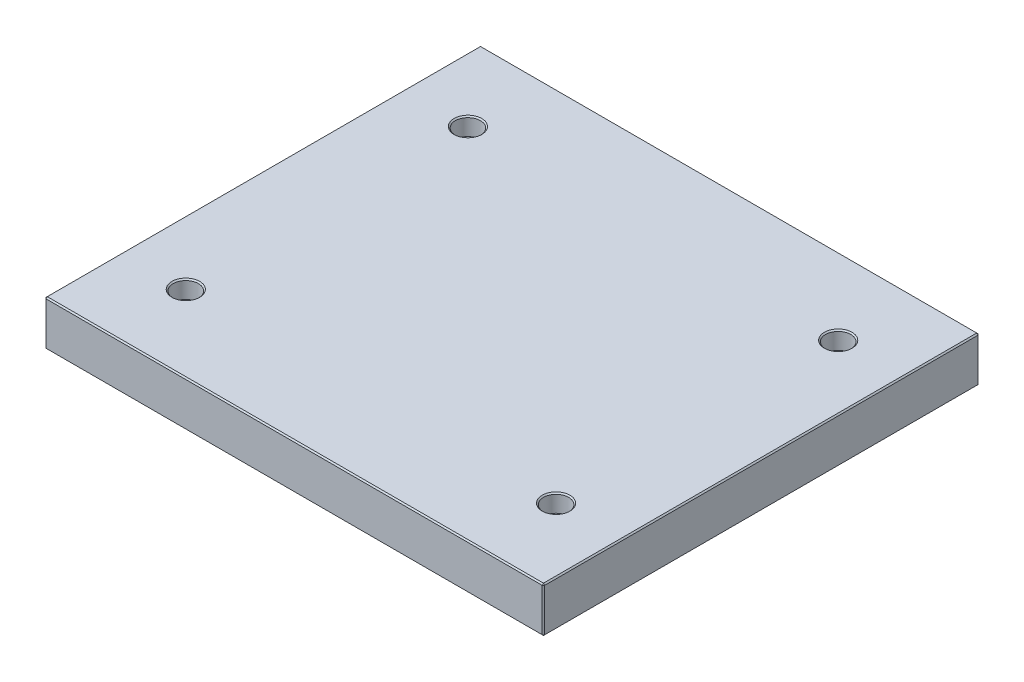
ISO-10303-21;
HEADER;
FILE_DESCRIPTION(('STEP AP214'),'2;1');
FILE_NAME('part.step','',(''),(''),'','','');
FILE_SCHEMA(('AUTOMOTIVE_DESIGN { 1 0 10303 214 1 1 1 1 }'));
ENDSEC;
DATA;
#1=APPLICATION_CONTEXT('core data for automotive mechanical design processes');
#2=APPLICATION_PROTOCOL_DEFINITION('international standard','automotive_design',2000,#1);
#3=PRODUCT_CONTEXT('',#1,'mechanical');
#4=PRODUCT('Part','Part','',(#3));
#5=PRODUCT_RELATED_PRODUCT_CATEGORY('part','',(#4));
#6=PRODUCT_DEFINITION_FORMATION('','',#4);
#7=PRODUCT_DEFINITION_CONTEXT('part definition',#1,'design');
#8=PRODUCT_DEFINITION('design','',#6,#7);
#9=PRODUCT_DEFINITION_SHAPE('','',#8);
#10=(LENGTH_UNIT() NAMED_UNIT(*) SI_UNIT(.MILLI.,.METRE.));
#11=(NAMED_UNIT(*) PLANE_ANGLE_UNIT() SI_UNIT($,.RADIAN.));
#12=(NAMED_UNIT(*) SI_UNIT($,.STERADIAN.) SOLID_ANGLE_UNIT());
#13=UNCERTAINTY_MEASURE_WITH_UNIT(LENGTH_MEASURE(1.E-05),#10,'distance_accuracy_value','');
#14=(GEOMETRIC_REPRESENTATION_CONTEXT(3) GLOBAL_UNCERTAINTY_ASSIGNED_CONTEXT((#13)) GLOBAL_UNIT_ASSIGNED_CONTEXT((#10,
#11,#12)) REPRESENTATION_CONTEXT('',''));
#15=CARTESIAN_POINT('',(0.,0.,0.));
#16=DIRECTION('',(0.,0.,1.));
#17=DIRECTION('',(1.,0.,0.));
#18=AXIS2_PLACEMENT_3D('',#15,#16,#17);
#19=CARTESIAN_POINT('',(-198.,36.,173.));
#20=DIRECTION('',(1.,0.,0.));
#21=DIRECTION('',(0.,0.,-1.));
#22=AXIS2_PLACEMENT_3D('',#19,#20,#21);
#23=PLANE('',#22);
#24=DIRECTION('',(0.,-1.,0.));
#25=VECTOR('',#24,1.);
#26=CARTESIAN_POINT('',(-198.,36.,-172.));
#27=LINE('',#26,#25);
#28=CARTESIAN_POINT('',(-198.,35.,-172.));
#29=VERTEX_POINT('',#28);
#30=CARTESIAN_POINT('',(-198.,1.,-172.));
#31=VERTEX_POINT('',#30);
#32=EDGE_CURVE('E115',#29,#31,#27,.T.);
#33=ORIENTED_EDGE('',*,*,#32,.T.);
#34=DIRECTION('',(0.,0.,1.));
#35=VECTOR('',#34,1.);
#36=CARTESIAN_POINT('',(-198.,1.,173.));
#37=LINE('',#36,#35);
#38=CARTESIAN_POINT('',(-198.,1.,172.));
#39=VERTEX_POINT('',#38);
#40=EDGE_CURVE('E111',#31,#39,#37,.T.);
#41=ORIENTED_EDGE('',*,*,#40,.T.);
#42=DIRECTION('',(0.,1.,0.));
#43=VECTOR('',#42,1.);
#44=CARTESIAN_POINT('',(-198.,36.,172.));
#45=LINE('',#44,#43);
#46=CARTESIAN_POINT('',(-198.,35.,172.));
#47=VERTEX_POINT('',#46);
#48=EDGE_CURVE('E104',#39,#47,#45,.T.);
#49=ORIENTED_EDGE('',*,*,#48,.T.);
#50=DIRECTION('',(0.,0.,-1.));
#51=VECTOR('',#50,1.);
#52=CARTESIAN_POINT('',(-198.,35.,-173.));
#53=LINE('',#52,#51);
#54=EDGE_CURVE('E108',#47,#29,#53,.T.);
#55=ORIENTED_EDGE('',*,*,#54,.T.);
#56=EDGE_LOOP('',(#33,#41,#49,#55));
#57=FACE_BOUND('',#56,.T.);
#58=ADVANCED_FACE('F16',(#57),#23,.F.);
#59=CARTESIAN_POINT('',(198.,36.,173.));
#60=DIRECTION('',(0.,0.,-1.));
#61=DIRECTION('',(-1.,0.,0.));
#62=AXIS2_PLACEMENT_3D('',#59,#60,#61);
#63=PLANE('',#62);
#64=DIRECTION('',(-1.,0.,0.));
#65=VECTOR('',#64,1.);
#66=CARTESIAN_POINT('',(-198.,35.,173.));
#67=LINE('',#66,#65);
#68=CARTESIAN_POINT('',(197.,35.,173.));
#69=VERTEX_POINT('',#68);
#70=CARTESIAN_POINT('',(-197.,35.,173.));
#71=VERTEX_POINT('',#70);
#72=EDGE_CURVE('E170',#69,#71,#67,.T.);
#73=ORIENTED_EDGE('',*,*,#72,.T.);
#74=DIRECTION('',(0.,-1.,0.));
#75=VECTOR('',#74,1.);
#76=CARTESIAN_POINT('',(-197.,36.,173.));
#77=LINE('',#76,#75);
#78=CARTESIAN_POINT('',(-197.,1.00000000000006,173.));
#79=VERTEX_POINT('',#78);
#80=EDGE_CURVE('E123',#71,#79,#77,.T.);
#81=ORIENTED_EDGE('',*,*,#80,.T.);
#82=DIRECTION('',(1.,0.,0.));
#83=VECTOR('',#82,1.);
#84=CARTESIAN_POINT('',(198.,1.00000000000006,173.));
#85=LINE('',#84,#83);
#86=CARTESIAN_POINT('',(197.,1.00000000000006,173.));
#87=VERTEX_POINT('',#86);
#88=EDGE_CURVE('E174',#79,#87,#85,.T.);
#89=ORIENTED_EDGE('',*,*,#88,.T.);
#90=DIRECTION('',(0.,1.,0.));
#91=VECTOR('',#90,1.);
#92=CARTESIAN_POINT('',(197.,36.,173.));
#93=LINE('',#92,#91);
#94=EDGE_CURVE('E172',#87,#69,#93,.T.);
#95=ORIENTED_EDGE('',*,*,#94,.T.);
#96=EDGE_LOOP('',(#73,#81,#89,#95));
#97=FACE_BOUND('',#96,.T.);
#98=ADVANCED_FACE('F317',(#97),#63,.F.);
#99=CARTESIAN_POINT('',(198.,36.,173.));
#100=DIRECTION('',(-1.,0.,0.));
#101=DIRECTION('',(0.,0.,1.));
#102=AXIS2_PLACEMENT_3D('',#99,#100,#101);
#103=PLANE('',#102);
#104=DIRECTION('',(0.,0.,-1.));
#105=VECTOR('',#104,1.);
#106=CARTESIAN_POINT('',(198.,1.00000000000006,173.));
#107=LINE('',#106,#105);
#108=CARTESIAN_POINT('',(198.,1.00000000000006,172.));
#109=VERTEX_POINT('',#108);
#110=CARTESIAN_POINT('',(198.,1.00000000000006,-172.));
#111=VERTEX_POINT('',#110);
#112=EDGE_CURVE('E165',#109,#111,#107,.T.);
#113=ORIENTED_EDGE('',*,*,#112,.T.);
#114=DIRECTION('',(0.,1.,0.));
#115=VECTOR('',#114,1.);
#116=CARTESIAN_POINT('',(198.,36.,-172.));
#117=LINE('',#116,#115);
#118=CARTESIAN_POINT('',(198.,35.,-172.));
#119=VERTEX_POINT('',#118);
#120=EDGE_CURVE('E167',#111,#119,#117,.T.);
#121=ORIENTED_EDGE('',*,*,#120,.T.);
#122=DIRECTION('',(0.,0.,1.));
#123=VECTOR('',#122,1.);
#124=CARTESIAN_POINT('',(198.,35.,173.));
#125=LINE('',#124,#123);
#126=CARTESIAN_POINT('',(198.,35.,172.));
#127=VERTEX_POINT('',#126);
#128=EDGE_CURVE('E161',#119,#127,#125,.T.);
#129=ORIENTED_EDGE('',*,*,#128,.T.);
#130=DIRECTION('',(0.,-1.,0.));
#131=VECTOR('',#130,1.);
#132=CARTESIAN_POINT('',(198.,36.,172.));
#133=LINE('',#132,#131);
#134=EDGE_CURVE('E163',#127,#109,#133,.T.);
#135=ORIENTED_EDGE('',*,*,#134,.T.);
#136=EDGE_LOOP('',(#113,#121,#129,#135));
#137=FACE_BOUND('',#136,.T.);
#138=ADVANCED_FACE('F323',(#137),#103,.F.);
#139=CARTESIAN_POINT('',(198.,36.,-173.));
#140=DIRECTION('',(0.,0.,1.));
#141=DIRECTION('',(1.,0.,0.));
#142=AXIS2_PLACEMENT_3D('',#139,#140,#141);
#143=PLANE('',#142);
#144=DIRECTION('',(0.,-1.,0.));
#145=VECTOR('',#144,1.);
#146=CARTESIAN_POINT('',(197.,36.,-173.));
#147=LINE('',#146,#145);
#148=CARTESIAN_POINT('',(197.,35.,-173.));
#149=VERTEX_POINT('',#148);
#150=CARTESIAN_POINT('',(197.,1.00000000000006,-173.));
#151=VERTEX_POINT('',#150);
#152=EDGE_CURVE('E154',#149,#151,#147,.T.);
#153=ORIENTED_EDGE('',*,*,#152,.T.);
#154=DIRECTION('',(-1.,0.,0.));
#155=VECTOR('',#154,1.);
#156=CARTESIAN_POINT('',(198.,1.00000000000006,-173.));
#157=LINE('',#156,#155);
#158=CARTESIAN_POINT('',(-197.,1.00000000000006,-173.));
#159=VERTEX_POINT('',#158);
#160=EDGE_CURVE('E159',#151,#159,#157,.T.);
#161=ORIENTED_EDGE('',*,*,#160,.T.);
#162=DIRECTION('',(0.,1.,0.));
#163=VECTOR('',#162,1.);
#164=CARTESIAN_POINT('',(-197.,36.,-173.));
#165=LINE('',#164,#163);
#166=CARTESIAN_POINT('',(-197.,35.,-173.));
#167=VERTEX_POINT('',#166);
#168=EDGE_CURVE('E156',#159,#167,#165,.T.);
#169=ORIENTED_EDGE('',*,*,#168,.T.);
#170=DIRECTION('',(1.,0.,0.));
#171=VECTOR('',#170,1.);
#172=CARTESIAN_POINT('',(198.,35.,-173.));
#173=LINE('',#172,#171);
#174=EDGE_CURVE('E152',#167,#149,#173,.T.);
#175=ORIENTED_EDGE('',*,*,#174,.T.);
#176=EDGE_LOOP('',(#153,#161,#169,#175));
#177=FACE_BOUND('',#176,.T.);
#178=ADVANCED_FACE('F465',(#177),#143,.F.);
#179=CARTESIAN_POINT('',(0.,36.,0.));
#180=DIRECTION('',(0.,1.,0.));
#181=DIRECTION('',(0.,0.,1.));
#182=AXIS2_PLACEMENT_3D('',#179,#180,#181);
#183=PLANE('',#182);
#184=CARTESIAN_POINT('',(-147.,36.,112.));
#185=DIRECTION('',(0.,1.,0.));
#186=DIRECTION('',(0.,0.,1.));
#187=AXIS2_PLACEMENT_3D('',#184,#185,#186);
#188=CIRCLE('',#187,11.);
#189=CARTESIAN_POINT('',(-147.,36.,123.));
#190=VERTEX_POINT('',#189);
#191=EDGE_CURVE('E290',#190,#190,#188,.F.);
#192=ORIENTED_EDGE('',*,*,#191,.T.);
#193=EDGE_LOOP('',(#192));
#194=FACE_BOUND('',#193,.T.);
#195=CARTESIAN_POINT('',(147.,36.,112.));
#196=DIRECTION('',(0.,1.,0.));
#197=DIRECTION('',(0.,0.,1.));
#198=AXIS2_PLACEMENT_3D('',#195,#196,#197);
#199=CIRCLE('',#198,11.);
#200=CARTESIAN_POINT('',(147.,36.,123.));
#201=VERTEX_POINT('',#200);
#202=EDGE_CURVE('E287',#201,#201,#199,.F.);
#203=ORIENTED_EDGE('',*,*,#202,.T.);
#204=EDGE_LOOP('',(#203));
#205=FACE_BOUND('',#204,.T.);
#206=CARTESIAN_POINT('',(147.,36.,-112.));
#207=DIRECTION('',(0.,1.,0.));
#208=DIRECTION('',(0.,0.,1.));
#209=AXIS2_PLACEMENT_3D('',#206,#207,#208);
#210=CIRCLE('',#209,11.);
#211=CARTESIAN_POINT('',(147.,36.,-101.));
#212=VERTEX_POINT('',#211);
#213=EDGE_CURVE('E284',#212,#212,#210,.F.);
#214=ORIENTED_EDGE('',*,*,#213,.T.);
#215=EDGE_LOOP('',(#214));
#216=FACE_BOUND('',#215,.T.);
#217=CARTESIAN_POINT('',(-147.,36.,-112.));
#218=DIRECTION('',(0.,1.,0.));
#219=DIRECTION('',(0.,0.,1.));
#220=AXIS2_PLACEMENT_3D('',#217,#218,#219);
#221=CIRCLE('',#220,11.);
#222=CARTESIAN_POINT('',(-147.,36.,-101.));
#223=VERTEX_POINT('',#222);
#224=EDGE_CURVE('E281',#223,#223,#221,.F.);
#225=ORIENTED_EDGE('',*,*,#224,.T.);
#226=EDGE_LOOP('',(#225));
#227=FACE_BOUND('',#226,.T.);
#228=DIRECTION('',(0.,0.,-1.));
#229=VECTOR('',#228,1.);
#230=CARTESIAN_POINT('',(197.,36.,-173.));
#231=LINE('',#230,#229);
#232=CARTESIAN_POINT('',(197.,36.,172.));
#233=VERTEX_POINT('',#232);
#234=CARTESIAN_POINT('',(197.,36.,-172.));
#235=VERTEX_POINT('',#234);
#236=EDGE_CURVE('E31',#233,#235,#231,.T.);
#237=ORIENTED_EDGE('',*,*,#236,.T.);
#238=DIRECTION('',(-1.,0.,0.));
#239=VECTOR('',#238,1.);
#240=CARTESIAN_POINT('',(-198.,36.,-172.));
#241=LINE('',#240,#239);
#242=CARTESIAN_POINT('',(-197.,36.,-172.));
#243=VERTEX_POINT('',#242);
#244=EDGE_CURVE('E190',#235,#243,#241,.T.);
#245=ORIENTED_EDGE('',*,*,#244,.T.);
#246=DIRECTION('',(0.,0.,1.));
#247=VECTOR('',#246,1.);
#248=CARTESIAN_POINT('',(-197.,36.,173.));
#249=LINE('',#248,#247);
#250=CARTESIAN_POINT('',(-197.,36.,172.));
#251=VERTEX_POINT('',#250);
#252=EDGE_CURVE('E186',#243,#251,#249,.T.);
#253=ORIENTED_EDGE('',*,*,#252,.T.);
#254=DIRECTION('',(1.,0.,0.));
#255=VECTOR('',#254,1.);
#256=CARTESIAN_POINT('',(198.,36.,172.));
#257=LINE('',#256,#255);
#258=EDGE_CURVE('E36',#251,#233,#257,.T.);
#259=ORIENTED_EDGE('',*,*,#258,.T.);
#260=EDGE_LOOP('',(#237,#245,#253,#259));
#261=FACE_BOUND('',#260,.T.);
#262=ADVANCED_FACE('F462',(#194,#205,#216,#227,#261),#183,.T.);
#263=CARTESIAN_POINT('',(0.,0.,0.));
#264=DIRECTION('',(0.,1.,0.));
#265=DIRECTION('',(0.,0.,1.));
#266=AXIS2_PLACEMENT_3D('',#263,#264,#265);
#267=PLANE('',#266);
#268=CARTESIAN_POINT('',(147.,0.,-112.));
#269=DIRECTION('',(0.,1.,0.));
#270=DIRECTION('',(0.,0.,1.));
#271=AXIS2_PLACEMENT_3D('',#268,#269,#270);
#272=CIRCLE('',#271,8.00000000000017);
#273=CARTESIAN_POINT('',(147.,0.,-104.));
#274=VERTEX_POINT('',#273);
#275=EDGE_CURVE('E263',#274,#274,#272,.T.);
#276=ORIENTED_EDGE('',*,*,#275,.T.);
#277=EDGE_LOOP('',(#276));
#278=FACE_BOUND('',#277,.T.);
#279=CARTESIAN_POINT('',(147.,0.,112.));
#280=DIRECTION('',(0.,1.,0.));
#281=DIRECTION('',(0.,0.,1.));
#282=AXIS2_PLACEMENT_3D('',#279,#280,#281);
#283=CIRCLE('',#282,8.);
#284=CARTESIAN_POINT('',(147.,0.,120.));
#285=VERTEX_POINT('',#284);
#286=EDGE_CURVE('E260',#285,#285,#283,.T.);
#287=ORIENTED_EDGE('',*,*,#286,.T.);
#288=EDGE_LOOP('',(#287));
#289=FACE_BOUND('',#288,.T.);
#290=CARTESIAN_POINT('',(-147.,0.,112.));
#291=DIRECTION('',(0.,1.,0.));
#292=DIRECTION('',(0.,0.,1.));
#293=AXIS2_PLACEMENT_3D('',#290,#291,#292);
#294=CIRCLE('',#293,8.);
#295=CARTESIAN_POINT('',(-147.,0.,120.));
#296=VERTEX_POINT('',#295);
#297=EDGE_CURVE('E257',#296,#296,#294,.T.);
#298=ORIENTED_EDGE('',*,*,#297,.T.);
#299=EDGE_LOOP('',(#298));
#300=FACE_BOUND('',#299,.T.);
#301=CARTESIAN_POINT('',(-147.,0.,-112.));
#302=DIRECTION('',(0.,1.,0.));
#303=DIRECTION('',(0.,0.,1.));
#304=AXIS2_PLACEMENT_3D('',#301,#302,#303);
#305=CIRCLE('',#304,8.);
#306=CARTESIAN_POINT('',(-147.,0.,-104.));
#307=VERTEX_POINT('',#306);
#308=EDGE_CURVE('E192',#307,#307,#305,.T.);
#309=ORIENTED_EDGE('',*,*,#308,.T.);
#310=EDGE_LOOP('',(#309));
#311=FACE_BOUND('',#310,.T.);
#312=DIRECTION('',(0.,0.,1.));
#313=VECTOR('',#312,1.);
#314=CARTESIAN_POINT('',(197.,0.,0.));
#315=LINE('',#314,#313);
#316=CARTESIAN_POINT('',(197.,0.,-172.));
#317=VERTEX_POINT('',#316);
#318=CARTESIAN_POINT('',(197.,0.,172.));
#319=VERTEX_POINT('',#318);
#320=EDGE_CURVE('E177',#317,#319,#315,.T.);
#321=ORIENTED_EDGE('',*,*,#320,.T.);
#322=DIRECTION('',(-1.,0.,0.));
#323=VECTOR('',#322,1.);
#324=CARTESIAN_POINT('',(0.,0.,172.));
#325=LINE('',#324,#323);
#326=CARTESIAN_POINT('',(-197.,0.,172.));
#327=VERTEX_POINT('',#326);
#328=EDGE_CURVE('E183',#319,#327,#325,.T.);
#329=ORIENTED_EDGE('',*,*,#328,.T.);
#330=DIRECTION('',(0.,0.,-1.));
#331=VECTOR('',#330,1.);
#332=CARTESIAN_POINT('',(-197.,0.,0.));
#333=LINE('',#332,#331);
#334=CARTESIAN_POINT('',(-197.,0.,-172.));
#335=VERTEX_POINT('',#334);
#336=EDGE_CURVE('E181',#327,#335,#333,.T.);
#337=ORIENTED_EDGE('',*,*,#336,.T.);
#338=DIRECTION('',(1.,0.,0.));
#339=VECTOR('',#338,1.);
#340=CARTESIAN_POINT('',(0.,0.,-172.));
#341=LINE('',#340,#339);
#342=EDGE_CURVE('E179',#335,#317,#341,.T.);
#343=ORIENTED_EDGE('',*,*,#342,.T.);
#344=EDGE_LOOP('',(#321,#329,#337,#343));
#345=FACE_BOUND('',#344,.T.);
#346=ADVANCED_FACE('F402',(#278,#289,#300,#311,#345),#267,.F.);
#347=CARTESIAN_POINT('',(198.,36.,172.));
#348=DIRECTION('',(-0.707106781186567,0.,-0.707106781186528));
#349=DIRECTION('',(0.,-1.,0.));
#350=AXIS2_PLACEMENT_3D('',#347,#348,#349);
#351=PLANE('',#350);
#352=DIRECTION('',(-0.707106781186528,0.,0.707106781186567));
#353=VECTOR('',#352,1.);
#354=CARTESIAN_POINT('',(197.,35.,173.));
#355=LINE('',#354,#353);
#356=EDGE_CURVE('E141',#69,#127,#355,.F.);
#357=ORIENTED_EDGE('',*,*,#356,.F.);
#358=ORIENTED_EDGE('',*,*,#94,.F.);
#359=DIRECTION('',(0.707106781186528,0.,-0.707106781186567));
#360=VECTOR('',#359,1.);
#361=CARTESIAN_POINT('',(197.,1.00000000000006,173.));
#362=LINE('',#361,#360);
#363=EDGE_CURVE('E144',#109,#87,#362,.F.);
#364=ORIENTED_EDGE('',*,*,#363,.F.);
#365=ORIENTED_EDGE('',*,*,#134,.F.);
#366=EDGE_LOOP('',(#357,#358,#364,#365));
#367=FACE_BOUND('',#366,.T.);
#368=ADVANCED_FACE('F398',(#367),#351,.F.);
#369=CARTESIAN_POINT('',(197.,35.,173.));
#370=DIRECTION('',(0.577350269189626,0.577350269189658,0.577350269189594));
#371=DIRECTION('',(-0.707106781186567,0.707106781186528,0.));
#372=AXIS2_PLACEMENT_3D('',#369,#370,#371);
#373=PLANE('',#372);
#374=DIRECTION('',(0.,-0.707106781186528,0.707106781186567));
#375=VECTOR('',#374,1.);
#376=CARTESIAN_POINT('',(197.,35.,173.));
#377=LINE('',#376,#375);
#378=EDGE_CURVE('E235',#69,#233,#377,.F.);
#379=ORIENTED_EDGE('',*,*,#378,.F.);
#380=ORIENTED_EDGE('',*,*,#356,.T.);
#381=DIRECTION('',(-0.707106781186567,0.707106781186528,0.));
#382=VECTOR('',#381,1.);
#383=CARTESIAN_POINT('',(197.5,35.5,172.));
#384=LINE('',#383,#382);
#385=EDGE_CURVE('E237',#233,#127,#384,.F.);
#386=ORIENTED_EDGE('',*,*,#385,.F.);
#387=EDGE_LOOP('',(#379,#380,#386));
#388=FACE_BOUND('',#387,.T.);
#389=ADVANCED_FACE('F394',(#388),#373,.T.);
#390=CARTESIAN_POINT('',(197.,1.00000000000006,173.));
#391=DIRECTION('',(0.577350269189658,-0.577350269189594,0.577350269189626));
#392=DIRECTION('',(0.707106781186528,0.,-0.707106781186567));
#393=AXIS2_PLACEMENT_3D('',#390,#391,#392);
#394=PLANE('',#393);
#395=DIRECTION('',(-0.707106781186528,-0.707106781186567,0.));
#396=VECTOR('',#395,1.);
#397=CARTESIAN_POINT('',(197.5,0.500000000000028,172.));
#398=LINE('',#397,#396);
#399=EDGE_CURVE('E229',#109,#319,#398,.T.);
#400=ORIENTED_EDGE('',*,*,#399,.F.);
#401=ORIENTED_EDGE('',*,*,#363,.T.);
#402=DIRECTION('',(0.,0.707106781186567,0.707106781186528));
#403=VECTOR('',#402,1.);
#404=CARTESIAN_POINT('',(197.,1.00000000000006,173.));
#405=LINE('',#404,#403);
#406=EDGE_CURVE('E232',#319,#87,#405,.T.);
#407=ORIENTED_EDGE('',*,*,#406,.F.);
#408=EDGE_LOOP('',(#400,#401,#407));
#409=FACE_BOUND('',#408,.T.);
#410=ADVANCED_FACE('F390',(#409),#394,.T.);
#411=CARTESIAN_POINT('',(197.,36.,0.));
#412=DIRECTION('',(0.707106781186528,0.707106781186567,0.));
#413=DIRECTION('',(0.,0.,1.));
#414=AXIS2_PLACEMENT_3D('',#411,#412,#413);
#415=PLANE('',#414);
#416=ORIENTED_EDGE('',*,*,#385,.T.);
#417=ORIENTED_EDGE('',*,*,#128,.F.);
#418=DIRECTION('',(0.707106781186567,-0.707106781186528,0.));
#419=VECTOR('',#418,1.);
#420=CARTESIAN_POINT('',(198.,35.,-172.));
#421=LINE('',#420,#419);
#422=EDGE_CURVE('E224',#235,#119,#421,.T.);
#423=ORIENTED_EDGE('',*,*,#422,.F.);
#424=ORIENTED_EDGE('',*,*,#236,.F.);
#425=EDGE_LOOP('',(#416,#417,#423,#424));
#426=FACE_BOUND('',#425,.T.);
#427=ADVANCED_FACE('F386',(#426),#415,.T.);
#428=CARTESIAN_POINT('',(0.,36.,172.));
#429=DIRECTION('',(0.,0.707106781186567,0.707106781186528));
#430=DIRECTION('',(-1.,0.,0.));
#431=AXIS2_PLACEMENT_3D('',#428,#429,#430);
#432=PLANE('',#431);
#433=ORIENTED_EDGE('',*,*,#378,.T.);
#434=ORIENTED_EDGE('',*,*,#258,.F.);
#435=DIRECTION('',(0.,0.707106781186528,-0.707106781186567));
#436=VECTOR('',#435,1.);
#437=CARTESIAN_POINT('',(-197.,35.5,172.5));
#438=LINE('',#437,#436);
#439=EDGE_CURVE('E127',#71,#251,#438,.T.);
#440=ORIENTED_EDGE('',*,*,#439,.F.);
#441=ORIENTED_EDGE('',*,*,#72,.F.);
#442=EDGE_LOOP('',(#433,#434,#440,#441));
#443=FACE_BOUND('',#442,.T.);
#444=ADVANCED_FACE('F383',(#443),#432,.T.);
#445=CARTESIAN_POINT('',(-197.,36.,173.));
#446=DIRECTION('',(0.707106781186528,0.,-0.707106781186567));
#447=DIRECTION('',(0.,-1.,0.));
#448=AXIS2_PLACEMENT_3D('',#445,#446,#447);
#449=PLANE('',#448);
#450=DIRECTION('',(0.707106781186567,0.,0.707106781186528));
#451=VECTOR('',#450,1.);
#452=CARTESIAN_POINT('',(-197.,1.00000000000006,173.));
#453=LINE('',#452,#451);
#454=EDGE_CURVE('E128',#79,#39,#453,.F.);
#455=ORIENTED_EDGE('',*,*,#454,.F.);
#456=ORIENTED_EDGE('',*,*,#80,.F.);
#457=DIRECTION('',(-0.707106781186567,0.,-0.707106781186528));
#458=VECTOR('',#457,1.);
#459=CARTESIAN_POINT('',(-198.,35.,172.));
#460=LINE('',#459,#458);
#461=EDGE_CURVE('E119',#47,#71,#460,.F.);
#462=ORIENTED_EDGE('',*,*,#461,.F.);
#463=ORIENTED_EDGE('',*,*,#48,.F.);
#464=EDGE_LOOP('',(#455,#456,#462,#463));
#465=FACE_BOUND('',#464,.T.);
#466=ADVANCED_FACE('F121',(#465),#449,.F.);
#467=CARTESIAN_POINT('',(198.,1.00000000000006,173.));
#468=DIRECTION('',(0.,0.707106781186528,-0.707106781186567));
#469=DIRECTION('',(1.,0.,0.));
#470=AXIS2_PLACEMENT_3D('',#467,#468,#469);
#471=PLANE('',#470);
#472=ORIENTED_EDGE('',*,*,#406,.T.);
#473=ORIENTED_EDGE('',*,*,#88,.F.);
#474=DIRECTION('',(0.,-0.707106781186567,-0.707106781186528));
#475=VECTOR('',#474,1.);
#476=CARTESIAN_POINT('',(-197.,1.00000000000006,173.));
#477=LINE('',#476,#475);
#478=EDGE_CURVE('E220',#327,#79,#477,.F.);
#479=ORIENTED_EDGE('',*,*,#478,.F.);
#480=ORIENTED_EDGE('',*,*,#328,.F.);
#481=EDGE_LOOP('',(#472,#473,#479,#480));
#482=FACE_BOUND('',#481,.T.);
#483=ADVANCED_FACE('F376',(#482),#471,.F.);
#484=CARTESIAN_POINT('',(198.,1.00000000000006,173.));
#485=DIRECTION('',(-0.707106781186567,0.707106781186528,0.));
#486=DIRECTION('',(0.,0.,-1.));
#487=AXIS2_PLACEMENT_3D('',#484,#485,#486);
#488=PLANE('',#487);
#489=ORIENTED_EDGE('',*,*,#399,.T.);
#490=ORIENTED_EDGE('',*,*,#320,.F.);
#491=DIRECTION('',(0.707106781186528,0.707106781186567,0.));
#492=VECTOR('',#491,1.);
#493=CARTESIAN_POINT('',(197.5,0.500000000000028,-172.));
#494=LINE('',#493,#492);
#495=EDGE_CURVE('E217',#111,#317,#494,.F.);
#496=ORIENTED_EDGE('',*,*,#495,.F.);
#497=ORIENTED_EDGE('',*,*,#112,.F.);
#498=EDGE_LOOP('',(#489,#490,#496,#497));
#499=FACE_BOUND('',#498,.T.);
#500=ADVANCED_FACE('F372',(#499),#488,.F.);
#501=CARTESIAN_POINT('',(197.,36.,-173.));
#502=DIRECTION('',(-0.707106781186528,0.,0.707106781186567));
#503=DIRECTION('',(0.,-1.,0.));
#504=AXIS2_PLACEMENT_3D('',#501,#502,#503);
#505=PLANE('',#504);
#506=DIRECTION('',(0.707106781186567,0.,0.707106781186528));
#507=VECTOR('',#506,1.);
#508=CARTESIAN_POINT('',(198.,35.,-172.));
#509=LINE('',#508,#507);
#510=EDGE_CURVE('E226',#119,#149,#509,.F.);
#511=ORIENTED_EDGE('',*,*,#510,.F.);
#512=ORIENTED_EDGE('',*,*,#120,.F.);
#513=DIRECTION('',(-0.707106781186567,0.,-0.707106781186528));
#514=VECTOR('',#513,1.);
#515=CARTESIAN_POINT('',(197.,1.00000000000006,-173.));
#516=LINE('',#515,#514);
#517=EDGE_CURVE('E214',#151,#111,#516,.F.);
#518=ORIENTED_EDGE('',*,*,#517,.F.);
#519=ORIENTED_EDGE('',*,*,#152,.F.);
#520=EDGE_LOOP('',(#511,#512,#518,#519));
#521=FACE_BOUND('',#520,.T.);
#522=ADVANCED_FACE('F368',(#521),#505,.F.);
#523=CARTESIAN_POINT('',(198.,35.,-172.));
#524=DIRECTION('',(0.577350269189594,0.577350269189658,-0.577350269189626));
#525=DIRECTION('',(0.,0.707106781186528,0.707106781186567));
#526=AXIS2_PLACEMENT_3D('',#523,#524,#525);
#527=PLANE('',#526);
#528=ORIENTED_EDGE('',*,*,#422,.T.);
#529=ORIENTED_EDGE('',*,*,#510,.T.);
#530=DIRECTION('',(0.,0.707106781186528,0.707106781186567));
#531=VECTOR('',#530,1.);
#532=CARTESIAN_POINT('',(197.,35.5,-172.5));
#533=LINE('',#532,#531);
#534=EDGE_CURVE('E135',#235,#149,#533,.F.);
#535=ORIENTED_EDGE('',*,*,#534,.F.);
#536=EDGE_LOOP('',(#528,#529,#535));
#537=FACE_BOUND('',#536,.T.);
#538=ADVANCED_FACE('F365',(#537),#527,.T.);
#539=CARTESIAN_POINT('',(-198.,35.,172.));
#540=DIRECTION('',(-0.577350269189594,0.577350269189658,0.577350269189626));
#541=DIRECTION('',(0.,-0.707106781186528,0.707106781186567));
#542=AXIS2_PLACEMENT_3D('',#539,#540,#541);
#543=PLANE('',#542);
#544=ORIENTED_EDGE('',*,*,#461,.T.);
#545=ORIENTED_EDGE('',*,*,#439,.T.);
#546=DIRECTION('',(-0.707106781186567,-0.707106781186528,0.));
#547=VECTOR('',#546,1.);
#548=CARTESIAN_POINT('',(-198.,35.,172.));
#549=LINE('',#548,#547);
#550=EDGE_CURVE('E131',#47,#251,#549,.F.);
#551=ORIENTED_EDGE('',*,*,#550,.F.);
#552=EDGE_LOOP('',(#544,#545,#551));
#553=FACE_BOUND('',#552,.T.);
#554=ADVANCED_FACE('F132',(#553),#543,.T.);
#555=CARTESIAN_POINT('',(-197.,1.00000000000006,173.));
#556=DIRECTION('',(-0.577350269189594,-0.577350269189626,0.577350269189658));
#557=DIRECTION('',(0.,-0.707106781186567,-0.707106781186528));
#558=AXIS2_PLACEMENT_3D('',#555,#556,#557);
#559=PLANE('',#558);
#560=ORIENTED_EDGE('',*,*,#478,.T.);
#561=ORIENTED_EDGE('',*,*,#454,.T.);
#562=DIRECTION('',(-0.707106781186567,0.707106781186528,0.));
#563=VECTOR('',#562,1.);
#564=CARTESIAN_POINT('',(-197.5,0.5,172.));
#565=LINE('',#564,#563);
#566=EDGE_CURVE('E136',#327,#39,#565,.T.);
#567=ORIENTED_EDGE('',*,*,#566,.F.);
#568=EDGE_LOOP('',(#560,#561,#567));
#569=FACE_BOUND('',#568,.T.);
#570=ADVANCED_FACE('F358',(#569),#559,.T.);
#571=CARTESIAN_POINT('',(197.,1.00000000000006,-173.));
#572=DIRECTION('',(0.577350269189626,-0.577350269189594,-0.577350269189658));
#573=DIRECTION('',(-0.707106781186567,0.,-0.707106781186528));
#574=AXIS2_PLACEMENT_3D('',#571,#572,#573);
#575=PLANE('',#574);
#576=ORIENTED_EDGE('',*,*,#517,.T.);
#577=ORIENTED_EDGE('',*,*,#495,.T.);
#578=DIRECTION('',(0.,-0.707106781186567,0.707106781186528));
#579=VECTOR('',#578,1.);
#580=CARTESIAN_POINT('',(197.,1.00000000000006,-173.));
#581=LINE('',#580,#579);
#582=EDGE_CURVE('E207',#151,#317,#581,.T.);
#583=ORIENTED_EDGE('',*,*,#582,.F.);
#584=EDGE_LOOP('',(#576,#577,#583));
#585=FACE_BOUND('',#584,.T.);
#586=ADVANCED_FACE('F354',(#585),#575,.T.);
#587=CARTESIAN_POINT('',(0.,36.,-172.));
#588=DIRECTION('',(0.,0.707106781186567,-0.707106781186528));
#589=DIRECTION('',(1.,0.,0.));
#590=AXIS2_PLACEMENT_3D('',#587,#588,#589);
#591=PLANE('',#590);
#592=ORIENTED_EDGE('',*,*,#534,.T.);
#593=ORIENTED_EDGE('',*,*,#174,.F.);
#594=DIRECTION('',(0.,-0.707106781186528,-0.707106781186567));
#595=VECTOR('',#594,1.);
#596=CARTESIAN_POINT('',(-197.,35.,-173.));
#597=LINE('',#596,#595);
#598=EDGE_CURVE('E204',#243,#167,#597,.T.);
#599=ORIENTED_EDGE('',*,*,#598,.F.);
#600=ORIENTED_EDGE('',*,*,#244,.F.);
#601=EDGE_LOOP('',(#592,#593,#599,#600));
#602=FACE_BOUND('',#601,.T.);
#603=ADVANCED_FACE('F351',(#602),#591,.T.);
#604=CARTESIAN_POINT('',(-197.,36.,0.));
#605=DIRECTION('',(-0.707106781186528,0.707106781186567,0.));
#606=DIRECTION('',(0.,0.,-1.));
#607=AXIS2_PLACEMENT_3D('',#604,#605,#606);
#608=PLANE('',#607);
#609=ORIENTED_EDGE('',*,*,#550,.T.);
#610=ORIENTED_EDGE('',*,*,#252,.F.);
#611=DIRECTION('',(0.707106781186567,0.707106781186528,0.));
#612=VECTOR('',#611,1.);
#613=CARTESIAN_POINT('',(-197.5,35.5,-172.));
#614=LINE('',#613,#612);
#615=EDGE_CURVE('E139',#29,#243,#614,.T.);
#616=ORIENTED_EDGE('',*,*,#615,.F.);
#617=ORIENTED_EDGE('',*,*,#54,.F.);
#618=EDGE_LOOP('',(#609,#610,#616,#617));
#619=FACE_BOUND('',#618,.T.);
#620=ADVANCED_FACE('F138',(#619),#608,.T.);
#621=CARTESIAN_POINT('',(-198.,1.,173.));
#622=DIRECTION('',(0.707106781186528,0.707106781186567,0.));
#623=DIRECTION('',(0.,0.,1.));
#624=AXIS2_PLACEMENT_3D('',#621,#622,#623);
#625=PLANE('',#624);
#626=ORIENTED_EDGE('',*,*,#566,.T.);
#627=ORIENTED_EDGE('',*,*,#40,.F.);
#628=DIRECTION('',(0.707106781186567,-0.707106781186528,0.));
#629=VECTOR('',#628,1.);
#630=CARTESIAN_POINT('',(-198.,1.,-172.));
#631=LINE('',#630,#629);
#632=EDGE_CURVE('E200',#335,#31,#631,.F.);
#633=ORIENTED_EDGE('',*,*,#632,.F.);
#634=ORIENTED_EDGE('',*,*,#336,.F.);
#635=EDGE_LOOP('',(#626,#627,#633,#634));
#636=FACE_BOUND('',#635,.T.);
#637=ADVANCED_FACE('F344',(#636),#625,.F.);
#638=CARTESIAN_POINT('',(198.,1.00000000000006,-173.));
#639=DIRECTION('',(0.,0.707106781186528,0.707106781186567));
#640=DIRECTION('',(-1.,0.,0.));
#641=AXIS2_PLACEMENT_3D('',#638,#639,#640);
#642=PLANE('',#641);
#643=ORIENTED_EDGE('',*,*,#582,.T.);
#644=ORIENTED_EDGE('',*,*,#342,.F.);
#645=DIRECTION('',(0.,0.707106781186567,-0.707106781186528));
#646=VECTOR('',#645,1.);
#647=CARTESIAN_POINT('',(-197.,0.500000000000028,-172.5));
#648=LINE('',#647,#646);
#649=EDGE_CURVE('E197',#159,#335,#648,.F.);
#650=ORIENTED_EDGE('',*,*,#649,.F.);
#651=ORIENTED_EDGE('',*,*,#160,.F.);
#652=EDGE_LOOP('',(#643,#644,#650,#651));
#653=FACE_BOUND('',#652,.T.);
#654=ADVANCED_FACE('F340',(#653),#642,.F.);
#655=CARTESIAN_POINT('',(-197.,35.,-173.));
#656=DIRECTION('',(-0.577350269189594,0.577350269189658,-0.577350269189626));
#657=DIRECTION('',(0.,0.707106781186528,0.707106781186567));
#658=AXIS2_PLACEMENT_3D('',#655,#656,#657);
#659=PLANE('',#658);
#660=ORIENTED_EDGE('',*,*,#615,.T.);
#661=ORIENTED_EDGE('',*,*,#598,.T.);
#662=DIRECTION('',(0.707106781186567,0.,-0.707106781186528));
#663=VECTOR('',#662,1.);
#664=CARTESIAN_POINT('',(-197.,35.,-173.));
#665=LINE('',#664,#663);
#666=EDGE_CURVE('E195',#29,#167,#665,.T.);
#667=ORIENTED_EDGE('',*,*,#666,.F.);
#668=EDGE_LOOP('',(#660,#661,#667));
#669=FACE_BOUND('',#668,.T.);
#670=ADVANCED_FACE('F336',(#669),#659,.T.);
#671=CARTESIAN_POINT('',(-198.,1.,-172.));
#672=DIRECTION('',(-0.577350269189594,-0.577350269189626,-0.577350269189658));
#673=DIRECTION('',(0.,0.707106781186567,-0.707106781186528));
#674=AXIS2_PLACEMENT_3D('',#671,#672,#673);
#675=PLANE('',#674);
#676=ORIENTED_EDGE('',*,*,#649,.T.);
#677=ORIENTED_EDGE('',*,*,#632,.T.);
#678=DIRECTION('',(-0.707106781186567,0.,0.707106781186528));
#679=VECTOR('',#678,1.);
#680=CARTESIAN_POINT('',(-198.,1.,-172.));
#681=LINE('',#680,#679);
#682=EDGE_CURVE('E193',#159,#31,#681,.T.);
#683=ORIENTED_EDGE('',*,*,#682,.F.);
#684=EDGE_LOOP('',(#676,#677,#683));
#685=FACE_BOUND('',#684,.T.);
#686=ADVANCED_FACE('F332',(#685),#675,.T.);
#687=CARTESIAN_POINT('',(-198.,36.,-172.));
#688=DIRECTION('',(0.707106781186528,0.,0.707106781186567));
#689=DIRECTION('',(0.,-1.,0.));
#690=AXIS2_PLACEMENT_3D('',#687,#688,#689);
#691=PLANE('',#690);
#692=ORIENTED_EDGE('',*,*,#666,.T.);
#693=ORIENTED_EDGE('',*,*,#168,.F.);
#694=ORIENTED_EDGE('',*,*,#682,.T.);
#695=ORIENTED_EDGE('',*,*,#32,.F.);
#696=EDGE_LOOP('',(#692,#693,#694,#695));
#697=FACE_BOUND('',#696,.T.);
#698=ADVANCED_FACE('F328',(#697),#691,.F.);
#699=CARTESIAN_POINT('',(-147.,22.,-112.));
#700=DIRECTION('',(0.,1.,0.));
#701=DIRECTION('',(0.,0.,1.));
#702=AXIS2_PLACEMENT_3D('',#699,#700,#701);
#703=CYLINDRICAL_SURFACE('',#702,10.);
#704=CARTESIAN_POINT('',(-147.,35.,-112.));
#705=DIRECTION('',(0.,1.,0.));
#706=DIRECTION('',(0.,0.,1.));
#707=AXIS2_PLACEMENT_3D('',#704,#705,#706);
#708=CIRCLE('',#707,10.);
#709=CARTESIAN_POINT('',(-147.,35.,-102.));
#710=VERTEX_POINT('',#709);
#711=EDGE_CURVE('E10',#710,#710,#708,.T.);
#712=ORIENTED_EDGE('',*,*,#711,.T.);
#713=EDGE_LOOP('',(#712));
#714=FACE_BOUND('',#713,.T.);
#715=CARTESIAN_POINT('',(-147.,22.,-112.));
#716=DIRECTION('',(0.,1.,0.));
#717=DIRECTION('',(0.,0.,1.));
#718=AXIS2_PLACEMENT_3D('',#715,#716,#717);
#719=CIRCLE('',#718,10.);
#720=CARTESIAN_POINT('',(-147.,22.,-102.));
#721=VERTEX_POINT('',#720);
#722=EDGE_CURVE('E147',#721,#721,#719,.T.);
#723=ORIENTED_EDGE('',*,*,#722,.F.);
#724=EDGE_LOOP('',(#723));
#725=FACE_BOUND('',#724,.T.);
#726=ADVANCED_FACE('F331',(#714,#725),#703,.F.);
#727=CARTESIAN_POINT('',(-147.,22.,-112.));
#728=DIRECTION('',(0.,1.,0.));
#729=DIRECTION('',(0.,0.,1.));
#730=AXIS2_PLACEMENT_3D('',#727,#728,#729);
#731=PLANE('',#730);
#732=CARTESIAN_POINT('',(-147.,22.,-112.));
#733=DIRECTION('',(0.,1.,0.));
#734=DIRECTION('',(0.,0.,1.));
#735=AXIS2_PLACEMENT_3D('',#732,#733,#734);
#736=CIRCLE('',#735,7.);
#737=CARTESIAN_POINT('',(-147.,22.,-105.));
#738=VERTEX_POINT('',#737);
#739=EDGE_CURVE('E251',#738,#738,#736,.T.);
#740=ORIENTED_EDGE('',*,*,#739,.F.);
#741=EDGE_LOOP('',(#740));
#742=FACE_BOUND('',#741,.T.);
#743=ORIENTED_EDGE('',*,*,#722,.T.);
#744=EDGE_LOOP('',(#743));
#745=FACE_BOUND('',#744,.T.);
#746=ADVANCED_FACE('F450',(#742,#745),#731,.T.);
#747=CARTESIAN_POINT('',(147.,22.,-112.));
#748=DIRECTION('',(0.,1.,0.));
#749=DIRECTION('',(0.,0.,1.));
#750=AXIS2_PLACEMENT_3D('',#747,#748,#749);
#751=CYLINDRICAL_SURFACE('',#750,10.);
#752=CARTESIAN_POINT('',(147.,35.,-112.));
#753=DIRECTION('',(0.,1.,0.));
#754=DIRECTION('',(0.,0.,1.));
#755=AXIS2_PLACEMENT_3D('',#752,#753,#754);
#756=CIRCLE('',#755,10.);
#757=CARTESIAN_POINT('',(147.,35.,-102.));
#758=VERTEX_POINT('',#757);
#759=EDGE_CURVE('E24',#758,#758,#756,.T.);
#760=ORIENTED_EDGE('',*,*,#759,.T.);
#761=EDGE_LOOP('',(#760));
#762=FACE_BOUND('',#761,.T.);
#763=CARTESIAN_POINT('',(147.,22.,-112.));
#764=DIRECTION('',(0.,1.,0.));
#765=DIRECTION('',(0.,0.,1.));
#766=AXIS2_PLACEMENT_3D('',#763,#764,#765);
#767=CIRCLE('',#766,10.);
#768=CARTESIAN_POINT('',(147.,22.,-102.));
#769=VERTEX_POINT('',#768);
#770=EDGE_CURVE('E441',#769,#769,#767,.T.);
#771=ORIENTED_EDGE('',*,*,#770,.F.);
#772=EDGE_LOOP('',(#771));
#773=FACE_BOUND('',#772,.T.);
#774=ADVANCED_FACE('F298',(#762,#773),#751,.F.);
#775=CARTESIAN_POINT('',(147.,22.,-112.));
#776=DIRECTION('',(0.,1.,0.));
#777=DIRECTION('',(0.,0.,1.));
#778=AXIS2_PLACEMENT_3D('',#775,#776,#777);
#779=PLANE('',#778);
#780=CARTESIAN_POINT('',(147.,22.,-112.));
#781=DIRECTION('',(0.,1.,0.));
#782=DIRECTION('',(0.,0.,1.));
#783=AXIS2_PLACEMENT_3D('',#780,#781,#782);
#784=CIRCLE('',#783,7.);
#785=CARTESIAN_POINT('',(147.,22.,-105.));
#786=VERTEX_POINT('',#785);
#787=EDGE_CURVE('E248',#786,#786,#784,.T.);
#788=ORIENTED_EDGE('',*,*,#787,.F.);
#789=EDGE_LOOP('',(#788));
#790=FACE_BOUND('',#789,.T.);
#791=ORIENTED_EDGE('',*,*,#770,.T.);
#792=EDGE_LOOP('',(#791));
#793=FACE_BOUND('',#792,.T.);
#794=ADVANCED_FACE('F738',(#790,#793),#779,.T.);
#795=CARTESIAN_POINT('',(147.,22.,112.));
#796=DIRECTION('',(0.,1.,0.));
#797=DIRECTION('',(0.,0.,1.));
#798=AXIS2_PLACEMENT_3D('',#795,#796,#797);
#799=CYLINDRICAL_SURFACE('',#798,10.);
#800=CARTESIAN_POINT('',(147.,35.,112.));
#801=DIRECTION('',(0.,1.,0.));
#802=DIRECTION('',(0.,0.,1.));
#803=AXIS2_PLACEMENT_3D('',#800,#801,#802);
#804=CIRCLE('',#803,10.);
#805=CARTESIAN_POINT('',(147.,35.,122.));
#806=VERTEX_POINT('',#805);
#807=EDGE_CURVE('E293',#806,#806,#804,.T.);
#808=ORIENTED_EDGE('',*,*,#807,.T.);
#809=EDGE_LOOP('',(#808));
#810=FACE_BOUND('',#809,.T.);
#811=CARTESIAN_POINT('',(147.,22.,112.));
#812=DIRECTION('',(0.,1.,0.));
#813=DIRECTION('',(0.,0.,1.));
#814=AXIS2_PLACEMENT_3D('',#811,#812,#813);
#815=CIRCLE('',#814,10.);
#816=CARTESIAN_POINT('',(147.,22.,122.));
#817=VERTEX_POINT('',#816);
#818=EDGE_CURVE('E439',#817,#817,#815,.T.);
#819=ORIENTED_EDGE('',*,*,#818,.F.);
#820=EDGE_LOOP('',(#819));
#821=FACE_BOUND('',#820,.T.);
#822=ADVANCED_FACE('F730',(#810,#821),#799,.F.);
#823=CARTESIAN_POINT('',(147.,22.,112.));
#824=DIRECTION('',(0.,1.,0.));
#825=DIRECTION('',(0.,0.,1.));
#826=AXIS2_PLACEMENT_3D('',#823,#824,#825);
#827=PLANE('',#826);
#828=CARTESIAN_POINT('',(147.,22.,112.));
#829=DIRECTION('',(0.,1.,0.));
#830=DIRECTION('',(0.,0.,1.));
#831=AXIS2_PLACEMENT_3D('',#828,#829,#830);
#832=CIRCLE('',#831,7.);
#833=CARTESIAN_POINT('',(147.,22.,119.));
#834=VERTEX_POINT('',#833);
#835=EDGE_CURVE('E245',#834,#834,#832,.T.);
#836=ORIENTED_EDGE('',*,*,#835,.F.);
#837=EDGE_LOOP('',(#836));
#838=FACE_BOUND('',#837,.T.);
#839=ORIENTED_EDGE('',*,*,#818,.T.);
#840=EDGE_LOOP('',(#839));
#841=FACE_BOUND('',#840,.T.);
#842=ADVANCED_FACE('F434',(#838,#841),#827,.T.);
#843=CARTESIAN_POINT('',(-147.,22.,112.));
#844=DIRECTION('',(0.,1.,0.));
#845=DIRECTION('',(0.,0.,1.));
#846=AXIS2_PLACEMENT_3D('',#843,#844,#845);
#847=CYLINDRICAL_SURFACE('',#846,10.);
#848=CARTESIAN_POINT('',(-147.,35.,112.));
#849=DIRECTION('',(0.,1.,0.));
#850=DIRECTION('',(0.,0.,1.));
#851=AXIS2_PLACEMENT_3D('',#848,#849,#850);
#852=CIRCLE('',#851,10.);
#853=CARTESIAN_POINT('',(-147.,35.,122.));
#854=VERTEX_POINT('',#853);
#855=EDGE_CURVE('E278',#854,#854,#852,.T.);
#856=ORIENTED_EDGE('',*,*,#855,.T.);
#857=EDGE_LOOP('',(#856));
#858=FACE_BOUND('',#857,.T.);
#859=CARTESIAN_POINT('',(-147.,22.,112.));
#860=DIRECTION('',(0.,1.,0.));
#861=DIRECTION('',(0.,0.,1.));
#862=AXIS2_PLACEMENT_3D('',#859,#860,#861);
#863=CIRCLE('',#862,10.);
#864=CARTESIAN_POINT('',(-147.,22.,122.));
#865=VERTEX_POINT('',#864);
#866=EDGE_CURVE('E254',#865,#865,#863,.T.);
#867=ORIENTED_EDGE('',*,*,#866,.F.);
#868=EDGE_LOOP('',(#867));
#869=FACE_BOUND('',#868,.T.);
#870=ADVANCED_FACE('F430',(#858,#869),#847,.F.);
#871=CARTESIAN_POINT('',(-147.,22.,112.));
#872=DIRECTION('',(0.,1.,0.));
#873=DIRECTION('',(0.,0.,1.));
#874=AXIS2_PLACEMENT_3D('',#871,#872,#873);
#875=PLANE('',#874);
#876=CARTESIAN_POINT('',(-147.,22.,112.));
#877=DIRECTION('',(0.,1.,0.));
#878=DIRECTION('',(0.,0.,1.));
#879=AXIS2_PLACEMENT_3D('',#876,#877,#878);
#880=CIRCLE('',#879,7.);
#881=CARTESIAN_POINT('',(-147.,22.,119.));
#882=VERTEX_POINT('',#881);
#883=EDGE_CURVE('E242',#882,#882,#880,.T.);
#884=ORIENTED_EDGE('',*,*,#883,.F.);
#885=EDGE_LOOP('',(#884));
#886=FACE_BOUND('',#885,.T.);
#887=ORIENTED_EDGE('',*,*,#866,.T.);
#888=EDGE_LOOP('',(#887));
#889=FACE_BOUND('',#888,.T.);
#890=ADVANCED_FACE('F433',(#886,#889),#875,.T.);
#891=CARTESIAN_POINT('',(-147.,0.,112.));
#892=DIRECTION('',(0.,1.,0.));
#893=DIRECTION('',(0.,0.,1.));
#894=AXIS2_PLACEMENT_3D('',#891,#892,#893);
#895=CYLINDRICAL_SURFACE('',#894,7.);
#896=CARTESIAN_POINT('',(-147.,0.99999999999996,112.));
#897=DIRECTION('',(0.,1.,0.));
#898=DIRECTION('',(0.,0.,1.));
#899=AXIS2_PLACEMENT_3D('',#896,#897,#898);
#900=CIRCLE('',#899,7.);
#901=CARTESIAN_POINT('',(-147.,0.99999999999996,119.));
#902=VERTEX_POINT('',#901);
#903=EDGE_CURVE('E272',#902,#902,#900,.F.);
#904=ORIENTED_EDGE('',*,*,#903,.T.);
#905=EDGE_LOOP('',(#904));
#906=FACE_BOUND('',#905,.T.);
#907=ORIENTED_EDGE('',*,*,#883,.T.);
#908=EDGE_LOOP('',(#907));
#909=FACE_BOUND('',#908,.T.);
#910=ADVANCED_FACE('F705',(#906,#909),#895,.F.);
#911=CARTESIAN_POINT('',(147.,0.,112.));
#912=DIRECTION('',(0.,1.,0.));
#913=DIRECTION('',(0.,0.,1.));
#914=AXIS2_PLACEMENT_3D('',#911,#912,#913);
#915=CYLINDRICAL_SURFACE('',#914,7.);
#916=CARTESIAN_POINT('',(147.,0.999999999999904,112.));
#917=DIRECTION('',(0.,1.,0.));
#918=DIRECTION('',(0.,0.,1.));
#919=AXIS2_PLACEMENT_3D('',#916,#917,#918);
#920=CIRCLE('',#919,7.);
#921=CARTESIAN_POINT('',(147.,0.999999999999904,119.));
#922=VERTEX_POINT('',#921);
#923=EDGE_CURVE('E269',#922,#922,#920,.F.);
#924=ORIENTED_EDGE('',*,*,#923,.T.);
#925=EDGE_LOOP('',(#924));
#926=FACE_BOUND('',#925,.T.);
#927=ORIENTED_EDGE('',*,*,#835,.T.);
#928=EDGE_LOOP('',(#927));
#929=FACE_BOUND('',#928,.T.);
#930=ADVANCED_FACE('F697',(#926,#929),#915,.F.);
#931=CARTESIAN_POINT('',(147.,0.,-112.));
#932=DIRECTION('',(0.,1.,0.));
#933=DIRECTION('',(0.,0.,1.));
#934=AXIS2_PLACEMENT_3D('',#931,#932,#933);
#935=CYLINDRICAL_SURFACE('',#934,7.);
#936=CARTESIAN_POINT('',(147.,1.00000000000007,-112.));
#937=DIRECTION('',(0.,1.,0.));
#938=DIRECTION('',(0.,0.,1.));
#939=AXIS2_PLACEMENT_3D('',#936,#937,#938);
#940=CIRCLE('',#939,7.);
#941=CARTESIAN_POINT('',(147.,1.00000000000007,-105.));
#942=VERTEX_POINT('',#941);
#943=EDGE_CURVE('E266',#942,#942,#940,.F.);
#944=ORIENTED_EDGE('',*,*,#943,.T.);
#945=EDGE_LOOP('',(#944));
#946=FACE_BOUND('',#945,.T.);
#947=ORIENTED_EDGE('',*,*,#787,.T.);
#948=EDGE_LOOP('',(#947));
#949=FACE_BOUND('',#948,.T.);
#950=ADVANCED_FACE('F688',(#946,#949),#935,.F.);
#951=CARTESIAN_POINT('',(-147.,0.,-112.));
#952=DIRECTION('',(0.,1.,0.));
#953=DIRECTION('',(0.,0.,1.));
#954=AXIS2_PLACEMENT_3D('',#951,#952,#953);
#955=CYLINDRICAL_SURFACE('',#954,7.);
#956=CARTESIAN_POINT('',(-147.,0.99999999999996,-112.));
#957=DIRECTION('',(0.,1.,0.));
#958=DIRECTION('',(0.,0.,1.));
#959=AXIS2_PLACEMENT_3D('',#956,#957,#958);
#960=CIRCLE('',#959,7.);
#961=CARTESIAN_POINT('',(-147.,0.99999999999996,-105.));
#962=VERTEX_POINT('',#961);
#963=EDGE_CURVE('E275',#962,#962,#960,.F.);
#964=ORIENTED_EDGE('',*,*,#963,.T.);
#965=EDGE_LOOP('',(#964));
#966=FACE_BOUND('',#965,.T.);
#967=ORIENTED_EDGE('',*,*,#739,.T.);
#968=EDGE_LOOP('',(#967));
#969=FACE_BOUND('',#968,.T.);
#970=ADVANCED_FACE('F408',(#966,#969),#955,.F.);
#971=CARTESIAN_POINT('',(147.,0.,-112.));
#972=DIRECTION('',(0.,-1.,0.));
#973=DIRECTION('',(0.,0.,-1.));
#974=AXIS2_PLACEMENT_3D('',#971,#972,#973);
#975=CONICAL_SURFACE('',#974,8.00000000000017,0.785398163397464);
#976=ORIENTED_EDGE('',*,*,#943,.F.);
#977=EDGE_LOOP('',(#976));
#978=FACE_BOUND('',#977,.T.);
#979=ORIENTED_EDGE('',*,*,#275,.F.);
#980=EDGE_LOOP('',(#979));
#981=FACE_BOUND('',#980,.T.);
#982=ADVANCED_FACE('F404',(#978,#981),#975,.F.);
#983=CARTESIAN_POINT('',(147.,0.,112.));
#984=DIRECTION('',(0.,-1.,0.));
#985=DIRECTION('',(0.,0.,-1.));
#986=AXIS2_PLACEMENT_3D('',#983,#984,#985);
#987=CONICAL_SURFACE('',#986,8.,0.785398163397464);
#988=ORIENTED_EDGE('',*,*,#923,.F.);
#989=EDGE_LOOP('',(#988));
#990=FACE_BOUND('',#989,.T.);
#991=ORIENTED_EDGE('',*,*,#286,.F.);
#992=EDGE_LOOP('',(#991));
#993=FACE_BOUND('',#992,.T.);
#994=ADVANCED_FACE('F407',(#990,#993),#987,.F.);
#995=CARTESIAN_POINT('',(-147.,0.,112.));
#996=DIRECTION('',(0.,-1.,0.));
#997=DIRECTION('',(0.,0.,-1.));
#998=AXIS2_PLACEMENT_3D('',#995,#996,#997);
#999=CONICAL_SURFACE('',#998,8.,0.785398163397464);
#1000=ORIENTED_EDGE('',*,*,#903,.F.);
#1001=EDGE_LOOP('',(#1000));
#1002=FACE_BOUND('',#1001,.T.);
#1003=ORIENTED_EDGE('',*,*,#297,.F.);
#1004=EDGE_LOOP('',(#1003));
#1005=FACE_BOUND('',#1004,.T.);
#1006=ADVANCED_FACE('F412',(#1002,#1005),#999,.F.);
#1007=CARTESIAN_POINT('',(-147.,0.,-112.));
#1008=DIRECTION('',(0.,-1.,0.));
#1009=DIRECTION('',(0.,0.,-1.));
#1010=AXIS2_PLACEMENT_3D('',#1007,#1008,#1009);
#1011=CONICAL_SURFACE('',#1010,8.,0.785398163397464);
#1012=ORIENTED_EDGE('',*,*,#963,.F.);
#1013=EDGE_LOOP('',(#1012));
#1014=FACE_BOUND('',#1013,.T.);
#1015=ORIENTED_EDGE('',*,*,#308,.F.);
#1016=EDGE_LOOP('',(#1015));
#1017=FACE_BOUND('',#1016,.T.);
#1018=ADVANCED_FACE('F416',(#1014,#1017),#1011,.F.);
#1019=CARTESIAN_POINT('',(-147.,35.,112.));
#1020=DIRECTION('',(0.,1.,0.));
#1021=DIRECTION('',(0.,0.,1.));
#1022=AXIS2_PLACEMENT_3D('',#1019,#1020,#1021);
#1023=CONICAL_SURFACE('',#1022,10.,0.785398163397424);
#1024=ORIENTED_EDGE('',*,*,#191,.F.);
#1025=EDGE_LOOP('',(#1024));
#1026=FACE_BOUND('',#1025,.T.);
#1027=ORIENTED_EDGE('',*,*,#855,.F.);
#1028=EDGE_LOOP('',(#1027));
#1029=FACE_BOUND('',#1028,.T.);
#1030=ADVANCED_FACE('F312',(#1026,#1029),#1023,.F.);
#1031=CARTESIAN_POINT('',(147.,35.,112.));
#1032=DIRECTION('',(0.,1.,0.));
#1033=DIRECTION('',(0.,0.,1.));
#1034=AXIS2_PLACEMENT_3D('',#1031,#1032,#1033);
#1035=CONICAL_SURFACE('',#1034,10.,0.785398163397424);
#1036=ORIENTED_EDGE('',*,*,#202,.F.);
#1037=EDGE_LOOP('',(#1036));
#1038=FACE_BOUND('',#1037,.T.);
#1039=ORIENTED_EDGE('',*,*,#807,.F.);
#1040=EDGE_LOOP('',(#1039));
#1041=FACE_BOUND('',#1040,.T.);
#1042=ADVANCED_FACE('F303',(#1038,#1041),#1035,.F.);
#1043=CARTESIAN_POINT('',(147.,35.,-112.));
#1044=DIRECTION('',(0.,1.,0.));
#1045=DIRECTION('',(0.,0.,1.));
#1046=AXIS2_PLACEMENT_3D('',#1043,#1044,#1045);
#1047=CONICAL_SURFACE('',#1046,10.,0.785398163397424);
#1048=ORIENTED_EDGE('',*,*,#213,.F.);
#1049=EDGE_LOOP('',(#1048));
#1050=FACE_BOUND('',#1049,.T.);
#1051=ORIENTED_EDGE('',*,*,#759,.F.);
#1052=EDGE_LOOP('',(#1051));
#1053=FACE_BOUND('',#1052,.T.);
#1054=ADVANCED_FACE('F301',(#1050,#1053),#1047,.F.);
#1055=CARTESIAN_POINT('',(-147.,35.,-112.));
#1056=DIRECTION('',(0.,1.,0.));
#1057=DIRECTION('',(0.,0.,1.));
#1058=AXIS2_PLACEMENT_3D('',#1055,#1056,#1057);
#1059=CONICAL_SURFACE('',#1058,10.,0.785398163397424);
#1060=ORIENTED_EDGE('',*,*,#224,.F.);
#1061=EDGE_LOOP('',(#1060));
#1062=FACE_BOUND('',#1061,.T.);
#1063=ORIENTED_EDGE('',*,*,#711,.F.);
#1064=EDGE_LOOP('',(#1063));
#1065=FACE_BOUND('',#1064,.T.);
#1066=ADVANCED_FACE('F18',(#1062,#1065),#1059,.F.);
#1067=CLOSED_SHELL('',(#58,#98,#138,#178,#262,#346,#368,#389,#410,#427,#444,#466,#483,#500,#522,
#538,#554,#570,#586,#603,#620,#637,#654,#670,#686,#698,#726,#746,#774,#794,#822,#842,#870,#890,
#910,#930,#950,#970,#982,#994,#1006,#1018,#1030,#1042,#1054,#1066));
#1068=MANIFOLD_SOLID_BREP('B1',#1067);
#1069=ADVANCED_BREP_SHAPE_REPRESENTATION('',(#18,#1068),#14);
#1070=SHAPE_DEFINITION_REPRESENTATION(#9,#1069);
ENDSEC;
END-ISO-10303-21;
